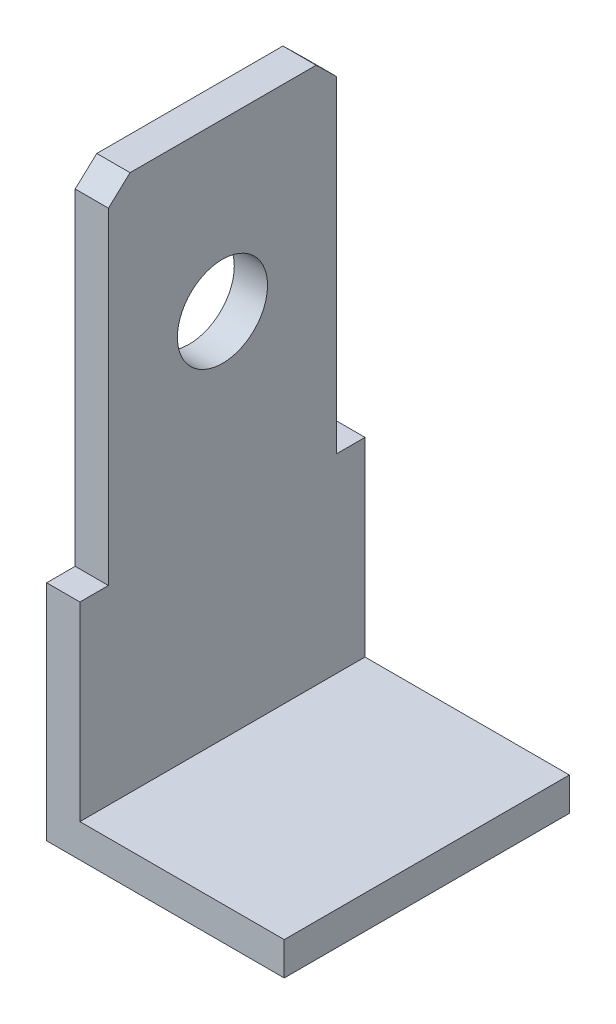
from build123d import *

# Parameters (mm, degrees)
AUFSATZ_LINEAR_AUSTRAGEN1_DEPTH = 6
SKIZZE2_R                       = 0.948914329
SCHNITT_LINEAR_AUSTRAGEN1_DEPTH = 1


with BuildPart() as part:
    # Skizze1 → Aufsatz-Linear austragen1 (new body)
    with BuildSketch(Plane.XY):
        Polygon((0, 0), (0, 12), (0.7, 12), (0.7, 0.7), (5, 0.7), (5, 0), align=None)
    extrude(amount=AUFSATZ_LINEAR_AUSTRAGEN1_DEPTH)

    # Skizze2 → Schnitt-Linear austragen1 (cut)
    with BuildSketch(Plane(origin=(0.7, 0, 0), x_dir=(0, 0, -1), z_dir=(1, 0, 0))):
        with Locations(Location((-3, 8.5, 0), (0, 0, 90))):
            Circle(SKIZZE2_R)
        Polygon((-0.6, 11.580463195), (-0.6, 4.70327223), (0, 4.70327223), (0, 12), (-1.028031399, 12), align=None)
        Polygon((-5.4, 11.580463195), (-5.4, 4.70327223), (-6, 4.70327223), (-6, 12), (-4.944533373, 12), align=None)
    extrude(amount=-SCHNITT_LINEAR_AUSTRAGEN1_DEPTH, mode=Mode.SUBTRACT)


solid = part.part
